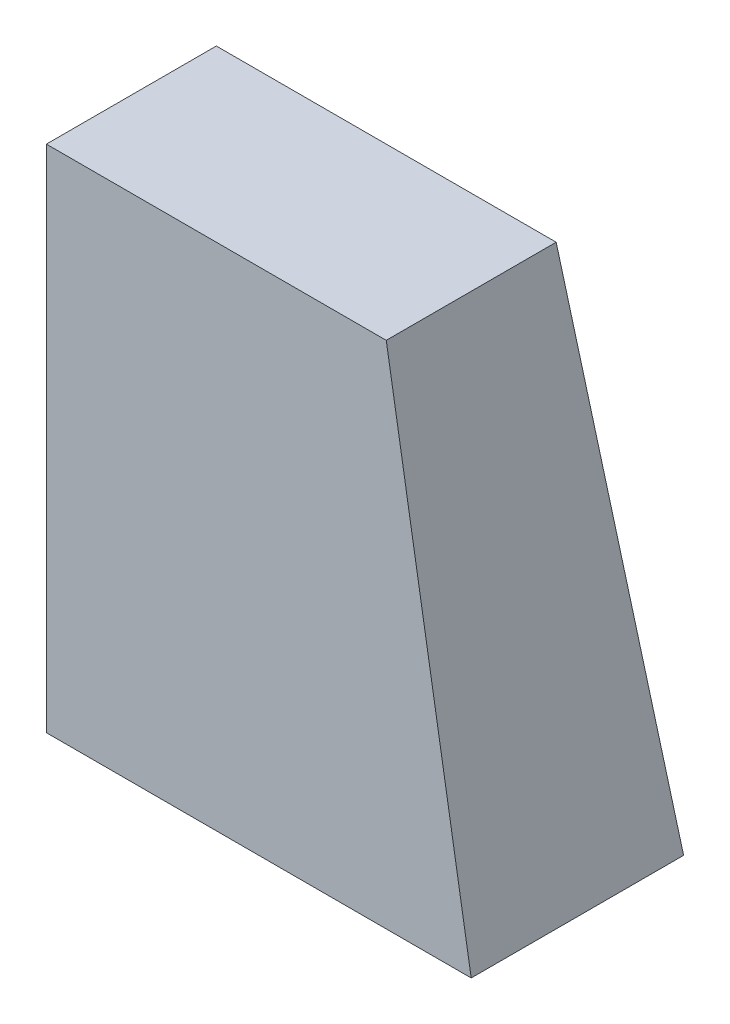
from build123d import *


with BuildPart() as part:
    # Sketch1 → Loft2 section 0
    with BuildSketch(Plane(origin=(0, 0, 0), x_dir=(1, 0, 0), z_dir=(0, 1, 0))):
        with BuildLine():
            Line((0, 0), (127, 0))
            Line((127, 0), (127, 63.5))
            Line((127, 63.5), (0, 63.5))
            Line((0, 63.5), (0, 0))
        make_face()
    # Sketch2 → Loft2 section 1
    with BuildSketch(Plane(origin=(0, 152.4, 0), x_dir=(-1, 0, 0), z_dir=(0, 1, 0))):
        with BuildLine():
            Line((0, 0), (-101.6, 0))
            Line((-101.6, 0), (-101.6, -50.8))
            Line((-101.6, -50.8), (0, -50.8))
            Line((0, -50.8), (0, 0))
        make_face()
    loft()


solid = part.part
